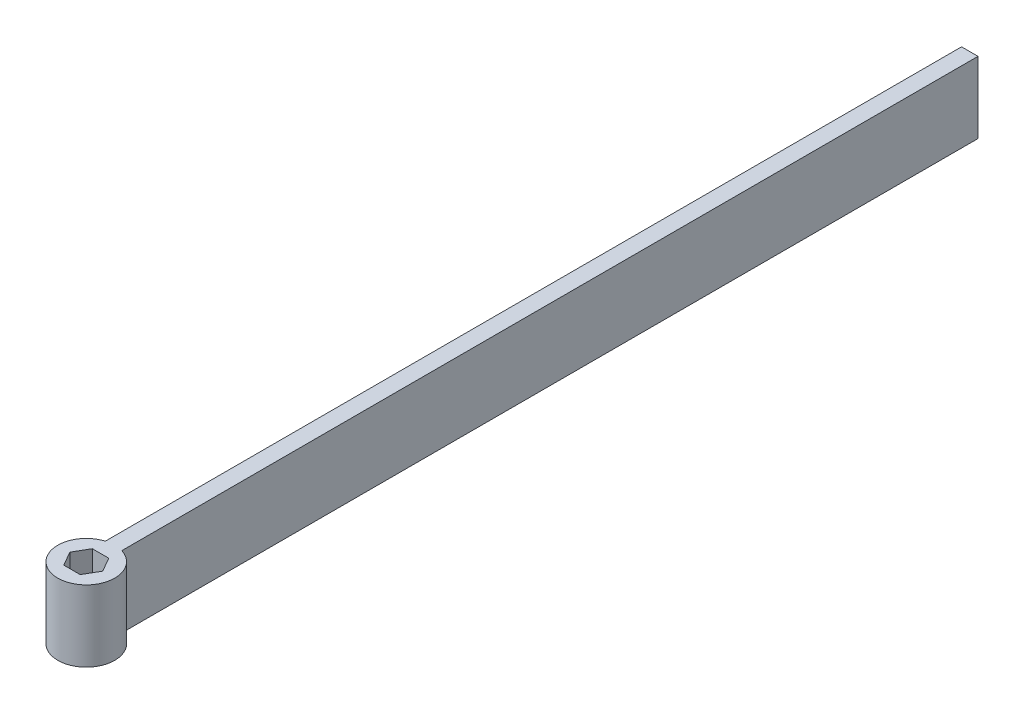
from build123d import *

# Parameters (mm, degrees)
SKETCH1_R           = 20
BOSS_EXTRUDE1_DEPTH = 50
SKETCH3_W           = 11.547005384
SKETCH3_H           = 50
BOSS_EXTRUDE2_DEPTH = 10
BOSS_EXTRUDE3_DEPTH = 600


with BuildPart() as part:
    # Sketch1 → Boss-Extrude1 (new body)
    with BuildSketch(Plane(origin=(0, 0, 0), x_dir=(1, 0, 0), z_dir=(0, 1, 0))):
        with Locations(Location((0, 0, 0), (0, 0, 270))):
            Circle(SKETCH1_R)
        Polygon((11.547005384, 0), (5.773502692, 10), (-5.773502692, 10), (-11.547005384, 0), (-5.773502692, -10), (5.773502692, -10), align=None, mode=Mode.SUBTRACT)
    extrude(amount=BOSS_EXTRUDE1_DEPTH)

    # Sketch3 → Boss-Extrude2 (add)
    with BuildSketch(Plane.XY.offset(-10)):
        with Locations((0, 25)):
            Rectangle(SKETCH3_W, SKETCH3_H)
    extrude(amount=-BOSS_EXTRUDE2_DEPTH)

    # Sketch4 → Boss-Extrude3 (add)
    with BuildSketch(Plane(origin=(0, 0, -20), x_dir=(-1, 0, 0), z_dir=(0, 0, -1))):
        Polygon((-2, 0), (-2, 45), (2, 45), (2, 0), (5.773502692, 0), (5.773502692, 50), (-5.773502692, 50), (-5.773502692, 0), align=None)
    extrude(amount=BOSS_EXTRUDE3_DEPTH)


solid = part.part
